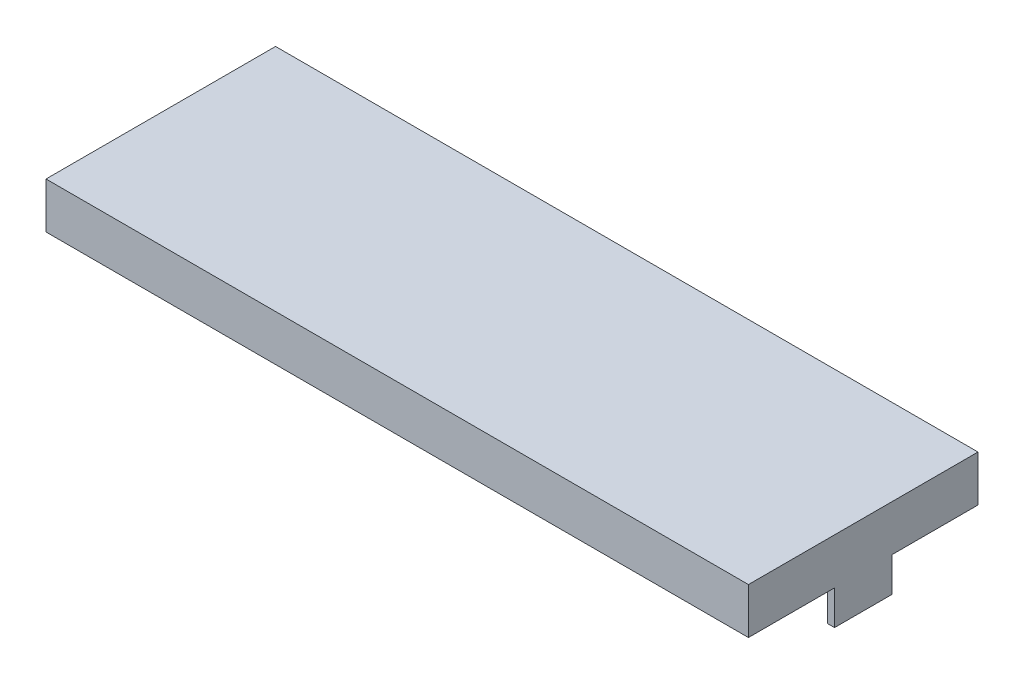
from build123d import *

# Parameters (mm, degrees)
SKIZZE1_W               = 306
SKIZZE1_H               = 20
LINEAR_AUSTRAGEN1_DEPTH = 50
SKIZZE2_W               = 3
SKIZZE2_H               = 25
LINEAR_AUSTRAGEN2_DEPTH = 15


with BuildPart() as part:
    # Skizze1 → Linear austragen1 (new, symmetric)
    with BuildSketch(Plane.XY):
        Rectangle(SKIZZE1_W, SKIZZE1_H)
    extrude(amount=LINEAR_AUSTRAGEN1_DEPTH, both=True)

    # Skizze2 → Linear austragen2 (add)
    with BuildSketch(Plane.XZ.offset(10)):
        with Locations((-151.5, 0)):
            Rectangle(SKIZZE2_W, SKIZZE2_H)
        with Locations((151.5, 0)):
            Rectangle(SKIZZE2_W, SKIZZE2_H)
    extrude(amount=LINEAR_AUSTRAGEN2_DEPTH)


solid = part.part
